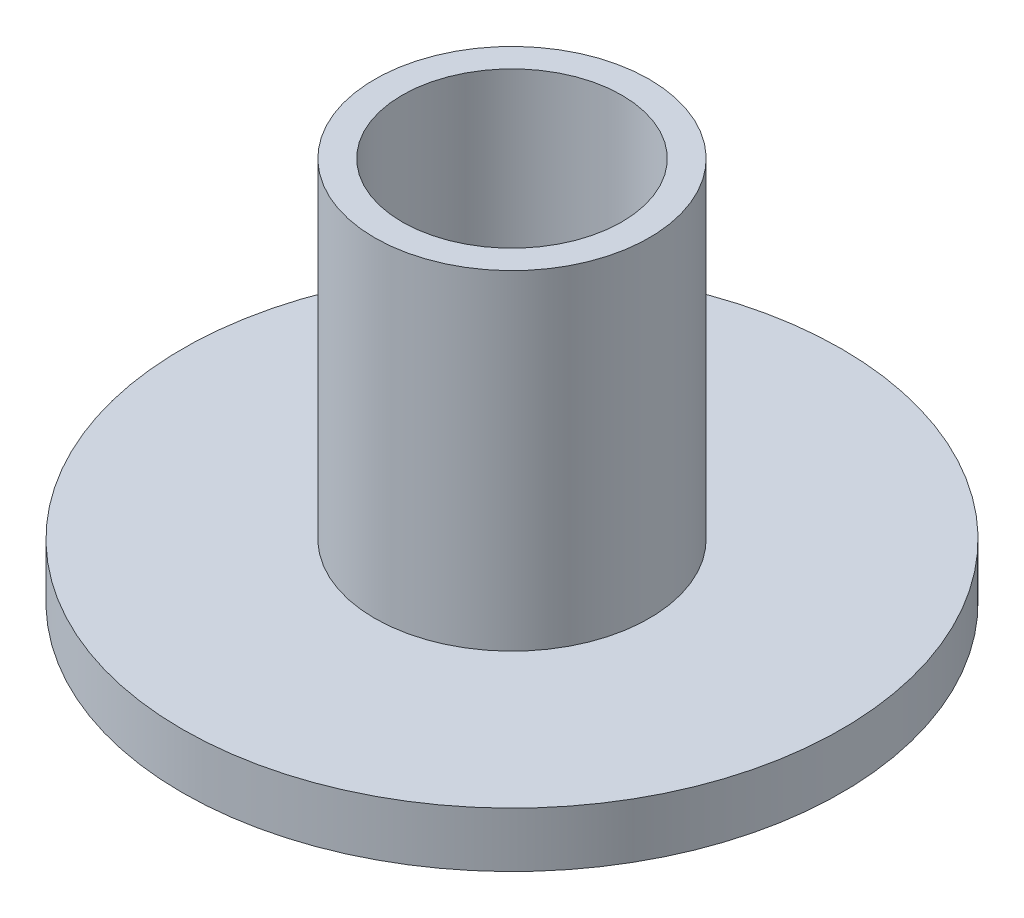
from build123d import *


with BuildPart() as part:
    # Sketch1 → Revolve1 (revolve)
    with BuildSketch(Plane.XY, mode=Mode.PRIVATE) as revolve1_sk:
        Polygon((25.4, 88.9), (25.4, 0), (76.2, 0), (76.2, 12.7), (31.75, 12.7), (31.75, 88.9), align=None)
    revolve(revolve1_sk.sketch.rotate(Axis((0, 55, 0), (0, -1, 0)), 90), axis=Axis((0, 55, 0), (0, -1, 0)))


solid = part.part
